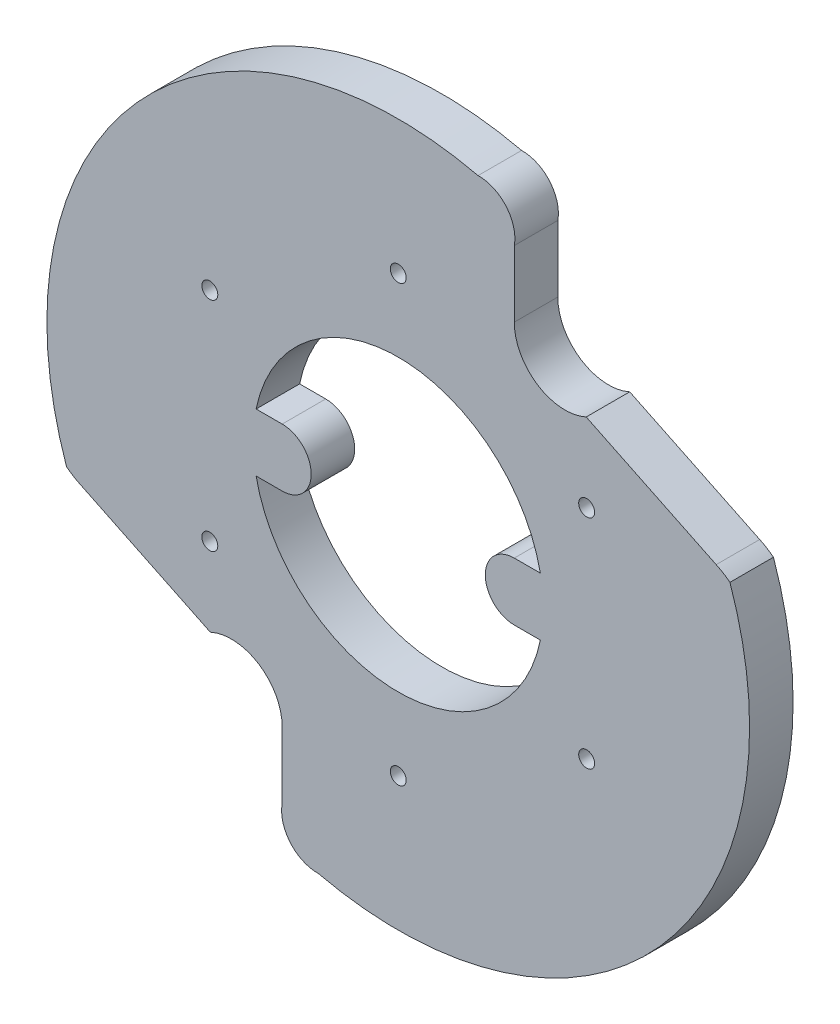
ISO-10303-21;
HEADER;
FILE_DESCRIPTION(('STEP AP214'),'2;1');
FILE_NAME('part.step','',(''),(''),'','','');
FILE_SCHEMA(('AUTOMOTIVE_DESIGN { 1 0 10303 214 1 1 1 1 }'));
ENDSEC;
DATA;
#1=APPLICATION_CONTEXT('core data for automotive mechanical design processes');
#2=APPLICATION_PROTOCOL_DEFINITION('international standard','automotive_design',2000,#1);
#3=PRODUCT_CONTEXT('',#1,'mechanical');
#4=PRODUCT('Part','Part','',(#3));
#5=PRODUCT_RELATED_PRODUCT_CATEGORY('part','',(#4));
#6=PRODUCT_DEFINITION_FORMATION('','',#4);
#7=PRODUCT_DEFINITION_CONTEXT('part definition',#1,'design');
#8=PRODUCT_DEFINITION('design','',#6,#7);
#9=PRODUCT_DEFINITION_SHAPE('','',#8);
#10=(LENGTH_UNIT() NAMED_UNIT(*) SI_UNIT(.MILLI.,.METRE.));
#11=(NAMED_UNIT(*) PLANE_ANGLE_UNIT() SI_UNIT($,.RADIAN.));
#12=(NAMED_UNIT(*) SI_UNIT($,.STERADIAN.) SOLID_ANGLE_UNIT());
#13=UNCERTAINTY_MEASURE_WITH_UNIT(LENGTH_MEASURE(1.E-05),#10,'distance_accuracy_value','');
#14=(GEOMETRIC_REPRESENTATION_CONTEXT(3) GLOBAL_UNCERTAINTY_ASSIGNED_CONTEXT((#13)) GLOBAL_UNIT_ASSIGNED_CONTEXT((#10,
#11,#12)) REPRESENTATION_CONTEXT('',''));
#15=CARTESIAN_POINT('',(0.,0.,0.));
#16=DIRECTION('',(0.,0.,1.));
#17=DIRECTION('',(1.,0.,0.));
#18=AXIS2_PLACEMENT_3D('',#15,#16,#17);
#19=CARTESIAN_POINT('',(0.,-7.77547884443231E-13,6.));
#20=DIRECTION('',(0.,0.,-1.));
#21=DIRECTION('',(-1.,0.,0.));
#22=AXIS2_PLACEMENT_3D('',#19,#20,#21);
#23=PLANE('',#22);
#24=CARTESIAN_POINT('',(-25.9807621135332,-15.0000000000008,6.));
#25=DIRECTION('',(0.,0.,1.));
#26=DIRECTION('',(1.,0.,0.));
#27=AXIS2_PLACEMENT_3D('',#24,#25,#26);
#28=CIRCLE('',#27,1.1);
#29=CARTESIAN_POINT('',(-24.8807621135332,-15.0000000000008,6.));
#30=VERTEX_POINT('',#29);
#31=EDGE_CURVE('E649',#30,#30,#28,.T.);
#32=ORIENTED_EDGE('',*,*,#31,.F.);
#33=EDGE_LOOP('',(#32));
#34=FACE_BOUND('',#33,.T.);
#35=CARTESIAN_POINT('',(25.9807621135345,-15.,6.));
#36=DIRECTION('',(0.,0.,1.));
#37=DIRECTION('',(1.,0.,0.));
#38=AXIS2_PLACEMENT_3D('',#35,#36,#37);
#39=CIRCLE('',#38,1.1);
#40=CARTESIAN_POINT('',(27.0807621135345,-15.,6.));
#41=VERTEX_POINT('',#40);
#42=EDGE_CURVE('E661',#41,#41,#39,.T.);
#43=ORIENTED_EDGE('',*,*,#42,.F.);
#44=EDGE_LOOP('',(#43));
#45=FACE_BOUND('',#44,.T.);
#46=CARTESIAN_POINT('',(0.,30.0000000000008,6.));
#47=DIRECTION('',(0.,0.,1.));
#48=DIRECTION('',(1.,0.,0.));
#49=AXIS2_PLACEMENT_3D('',#46,#47,#48);
#50=CIRCLE('',#49,1.1);
#51=CARTESIAN_POINT('',(1.1,30.0000000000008,6.));
#52=VERTEX_POINT('',#51);
#53=EDGE_CURVE('E212',#52,#52,#50,.T.);
#54=ORIENTED_EDGE('',*,*,#53,.F.);
#55=EDGE_LOOP('',(#54));
#56=FACE_BOUND('',#55,.T.);
#57=CARTESIAN_POINT('',(0.,-7.77547884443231E-13,6.));
#58=DIRECTION('',(0.,0.,1.));
#59=DIRECTION('',(-1.,0.,0.));
#60=AXIS2_PLACEMENT_3D('',#57,#58,#59);
#61=CIRCLE('',#60,48.4425133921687);
#62=CARTESIAN_POINT('',(11.0082214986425,47.1751646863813,6.));
#63=VERTEX_POINT('',#62);
#64=CARTESIAN_POINT('',(-45.734120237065,-15.9708280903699,6.));
#65=VERTEX_POINT('',#64);
#66=EDGE_CURVE('E242',#63,#65,#61,.T.);
#67=ORIENTED_EDGE('',*,*,#66,.T.);
#68=CARTESIAN_POINT('',(-39.5815499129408,-8.08756237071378,6.));
#69=DIRECTION('',(0.,0.,1.));
#70=DIRECTION('',(-1.,0.,0.));
#71=AXIS2_PLACEMENT_3D('',#68,#69,#70);
#72=CIRCLE('',#71,10.);
#73=CARTESIAN_POINT('',(-43.8383260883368,-17.1363112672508,6.));
#74=VERTEX_POINT('',#73);
#75=EDGE_CURVE('E245',#65,#74,#72,.T.);
#76=ORIENTED_EDGE('',*,*,#75,.T.);
#77=DIRECTION('',(0.900284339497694,-0.435302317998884,0.));
#78=VECTOR('',#77,1.);
#79=CARTESIAN_POINT('',(-25.9127678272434,-25.8036141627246,6.));
#80=LINE('',#79,#78);
#81=CARTESIAN_POINT('',(-25.9127678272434,-25.8036141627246,6.));
#82=VERTEX_POINT('',#81);
#83=EDGE_CURVE('E248',#74,#82,#80,.T.);
#84=ORIENTED_EDGE('',*,*,#83,.T.);
#85=CARTESIAN_POINT('',(-23.,-32.1688151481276,6.));
#86=DIRECTION('',(0.,0.,-1.));
#87=DIRECTION('',(-1.,0.,0.));
#88=AXIS2_PLACEMENT_3D('',#85,#86,#87);
#89=CIRCLE('',#88,7.);
#90=CARTESIAN_POINT('',(-16.,-32.1688151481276,6.));
#91=VERTEX_POINT('',#90);
#92=EDGE_CURVE('E250',#82,#91,#89,.T.);
#93=ORIENTED_EDGE('',*,*,#92,.T.);
#94=DIRECTION('',(0.,-1.,0.));
#95=VECTOR('',#94,1.);
#96=CARTESIAN_POINT('',(-16.,-32.1688151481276,6.));
#97=LINE('',#96,#95);
#98=CARTESIAN_POINT('',(-16.,-41.3096230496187,6.));
#99=VERTEX_POINT('',#98);
#100=EDGE_CURVE('E252',#91,#99,#97,.T.);
#101=ORIENTED_EDGE('',*,*,#100,.T.);
#102=CARTESIAN_POINT('',(-11.0938061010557,-42.1911413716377,6.));
#103=DIRECTION('',(0.,0.,1.));
#104=DIRECTION('',(-1.,0.,0.));
#105=AXIS2_PLACEMENT_3D('',#102,#103,#104);
#106=CIRCLE('',#105,4.98475808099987);
#107=CARTESIAN_POINT('',(-11.0082214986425,-47.1751646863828,6.));
#108=VERTEX_POINT('',#107);
#109=EDGE_CURVE('E254',#99,#108,#106,.T.);
#110=ORIENTED_EDGE('',*,*,#109,.T.);
#111=CARTESIAN_POINT('',(0.,-7.77547884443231E-13,6.));
#112=DIRECTION('',(0.,0.,1.));
#113=DIRECTION('',(-1.,0.,0.));
#114=AXIS2_PLACEMENT_3D('',#111,#112,#113);
#115=CIRCLE('',#114,48.4425133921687);
#116=CARTESIAN_POINT('',(45.734120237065,15.9708280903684,6.));
#117=VERTEX_POINT('',#116);
#118=EDGE_CURVE('E256',#108,#117,#115,.T.);
#119=ORIENTED_EDGE('',*,*,#118,.T.);
#120=CARTESIAN_POINT('',(39.5815499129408,8.08756237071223,6.));
#121=DIRECTION('',(0.,0.,1.));
#122=DIRECTION('',(-1.,0.,0.));
#123=AXIS2_PLACEMENT_3D('',#120,#121,#122);
#124=CIRCLE('',#123,10.);
#125=CARTESIAN_POINT('',(43.8383260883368,17.1363112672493,6.));
#126=VERTEX_POINT('',#125);
#127=EDGE_CURVE('E258',#117,#126,#124,.T.);
#128=ORIENTED_EDGE('',*,*,#127,.T.);
#129=DIRECTION('',(-0.900284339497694,0.435302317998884,0.));
#130=VECTOR('',#129,1.);
#131=CARTESIAN_POINT('',(25.9127678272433,25.803614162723,6.));
#132=LINE('',#131,#130);
#133=CARTESIAN_POINT('',(25.9127678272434,25.803614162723,6.));
#134=VERTEX_POINT('',#133);
#135=EDGE_CURVE('E260',#126,#134,#132,.T.);
#136=ORIENTED_EDGE('',*,*,#135,.T.);
#137=CARTESIAN_POINT('',(23.,32.1688151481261,6.));
#138=DIRECTION('',(0.,0.,-1.));
#139=DIRECTION('',(-1.,0.,0.));
#140=AXIS2_PLACEMENT_3D('',#137,#138,#139);
#141=CIRCLE('',#140,7.);
#142=CARTESIAN_POINT('',(16.,32.1688151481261,6.));
#143=VERTEX_POINT('',#142);
#144=EDGE_CURVE('E262',#134,#143,#141,.T.);
#145=ORIENTED_EDGE('',*,*,#144,.T.);
#146=DIRECTION('',(0.,1.,0.));
#147=VECTOR('',#146,1.);
#148=CARTESIAN_POINT('',(16.,32.1688151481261,6.));
#149=LINE('',#148,#147);
#150=CARTESIAN_POINT('',(16.,41.3096230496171,6.));
#151=VERTEX_POINT('',#150);
#152=EDGE_CURVE('E264',#143,#151,#149,.T.);
#153=ORIENTED_EDGE('',*,*,#152,.T.);
#154=CARTESIAN_POINT('',(11.0938061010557,42.1911413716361,6.));
#155=DIRECTION('',(0.,0.,1.));
#156=DIRECTION('',(-1.,0.,0.));
#157=AXIS2_PLACEMENT_3D('',#154,#155,#156);
#158=CIRCLE('',#157,4.98475808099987);
#159=EDGE_CURVE('E266',#151,#63,#158,.T.);
#160=ORIENTED_EDGE('',*,*,#159,.T.);
#161=EDGE_LOOP('',(#67,#76,#84,#93,#101,#110,#119,#128,#136,#145,#153,#160));
#162=FACE_BOUND('',#161,.T.);
#163=CARTESIAN_POINT('',(0.,-7.77547884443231E-13,6.));
#164=DIRECTION('',(0.,0.,1.));
#165=DIRECTION('',(1.,0.,0.));
#166=AXIS2_PLACEMENT_3D('',#163,#164,#165);
#167=CIRCLE('',#166,20.);
#168=CARTESIAN_POINT('',(19.5959179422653,4.,6.));
#169=VERTEX_POINT('',#168);
#170=CARTESIAN_POINT('',(-19.5959179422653,4.,6.));
#171=VERTEX_POINT('',#170);
#172=EDGE_CURVE('E174',#169,#171,#167,.T.);
#173=ORIENTED_EDGE('',*,*,#172,.F.);
#174=DIRECTION('',(1.,0.,0.));
#175=VECTOR('',#174,1.);
#176=CARTESIAN_POINT('',(16.,4.,6.));
#177=LINE('',#176,#175);
#178=CARTESIAN_POINT('',(16.,4.,6.));
#179=VERTEX_POINT('',#178);
#180=EDGE_CURVE('E209',#179,#169,#177,.T.);
#181=ORIENTED_EDGE('',*,*,#180,.F.);
#182=CARTESIAN_POINT('',(16.,0.,6.));
#183=DIRECTION('',(0.,0.,-1.));
#184=DIRECTION('',(-1.,0.,0.));
#185=AXIS2_PLACEMENT_3D('',#182,#183,#184);
#186=CIRCLE('',#185,4.);
#187=CARTESIAN_POINT('',(16.,-4.,6.));
#188=VERTEX_POINT('',#187);
#189=EDGE_CURVE('E207',#188,#179,#186,.T.);
#190=ORIENTED_EDGE('',*,*,#189,.F.);
#191=DIRECTION('',(-1.,0.,0.));
#192=VECTOR('',#191,1.);
#193=CARTESIAN_POINT('',(16.,-4.,6.));
#194=LINE('',#193,#192);
#195=CARTESIAN_POINT('',(19.5959179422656,-4.,6.));
#196=VERTEX_POINT('',#195);
#197=EDGE_CURVE('E205',#196,#188,#194,.T.);
#198=ORIENTED_EDGE('',*,*,#197,.F.);
#199=CARTESIAN_POINT('',(0.,-7.77547884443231E-13,6.));
#200=DIRECTION('',(0.,0.,1.));
#201=DIRECTION('',(1.,0.,0.));
#202=AXIS2_PLACEMENT_3D('',#199,#200,#201);
#203=CIRCLE('',#202,20.);
#204=CARTESIAN_POINT('',(-19.5959179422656,-4.,6.));
#205=VERTEX_POINT('',#204);
#206=EDGE_CURVE('E203',#205,#196,#203,.T.);
#207=ORIENTED_EDGE('',*,*,#206,.F.);
#208=DIRECTION('',(-1.,0.,0.));
#209=VECTOR('',#208,1.);
#210=CARTESIAN_POINT('',(-16.,-4.,6.));
#211=LINE('',#210,#209);
#212=CARTESIAN_POINT('',(-16.,-4.,6.));
#213=VERTEX_POINT('',#212);
#214=EDGE_CURVE('E198',#213,#205,#211,.T.);
#215=ORIENTED_EDGE('',*,*,#214,.F.);
#216=CARTESIAN_POINT('',(-16.,0.,6.));
#217=DIRECTION('',(0.,0.,-1.));
#218=DIRECTION('',(1.,0.,0.));
#219=AXIS2_PLACEMENT_3D('',#216,#217,#218);
#220=CIRCLE('',#219,4.);
#221=CARTESIAN_POINT('',(-16.,4.,6.));
#222=VERTEX_POINT('',#221);
#223=EDGE_CURVE('E196',#222,#213,#220,.T.);
#224=ORIENTED_EDGE('',*,*,#223,.F.);
#225=DIRECTION('',(1.,0.,0.));
#226=VECTOR('',#225,1.);
#227=CARTESIAN_POINT('',(-16.,4.,6.));
#228=LINE('',#227,#226);
#229=EDGE_CURVE('E182',#171,#222,#228,.T.);
#230=ORIENTED_EDGE('',*,*,#229,.F.);
#231=EDGE_LOOP('',(#173,#181,#190,#198,#207,#215,#224,#230));
#232=FACE_BOUND('',#231,.T.);
#233=CARTESIAN_POINT('',(25.9807621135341,15.0000000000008,6.));
#234=DIRECTION('',(0.,0.,1.));
#235=DIRECTION('',(1.,0.,0.));
#236=AXIS2_PLACEMENT_3D('',#233,#234,#235);
#237=CIRCLE('',#236,1.1);
#238=CARTESIAN_POINT('',(27.0807621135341,15.0000000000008,6.));
#239=VERTEX_POINT('',#238);
#240=EDGE_CURVE('E667',#239,#239,#237,.T.);
#241=ORIENTED_EDGE('',*,*,#240,.F.);
#242=EDGE_LOOP('',(#241));
#243=FACE_BOUND('',#242,.T.);
#244=CARTESIAN_POINT('',(8.31799906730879E-13,-30.0000000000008,6.));
#245=DIRECTION('',(0.,0.,1.));
#246=DIRECTION('',(1.,0.,0.));
#247=AXIS2_PLACEMENT_3D('',#244,#245,#246);
#248=CIRCLE('',#247,1.1);
#249=CARTESIAN_POINT('',(1.10000000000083,-30.0000000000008,6.));
#250=VERTEX_POINT('',#249);
#251=EDGE_CURVE('E655',#250,#250,#248,.T.);
#252=ORIENTED_EDGE('',*,*,#251,.F.);
#253=EDGE_LOOP('',(#252));
#254=FACE_BOUND('',#253,.T.);
#255=CARTESIAN_POINT('',(-25.9807621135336,15.,6.));
#256=DIRECTION('',(0.,0.,1.));
#257=DIRECTION('',(1.,0.,0.));
#258=AXIS2_PLACEMENT_3D('',#255,#256,#257);
#259=CIRCLE('',#258,1.1);
#260=CARTESIAN_POINT('',(-24.8807621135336,15.,6.));
#261=VERTEX_POINT('',#260);
#262=EDGE_CURVE('E640',#261,#261,#259,.T.);
#263=ORIENTED_EDGE('',*,*,#262,.F.);
#264=EDGE_LOOP('',(#263));
#265=FACE_BOUND('',#264,.T.);
#266=ADVANCED_FACE('F37',(#34,#45,#56,#162,#232,#243,#254,#265),#23,.F.);
#267=CARTESIAN_POINT('',(0.,-7.77547884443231E-13,0.));
#268=DIRECTION('',(0.,0.,-1.));
#269=DIRECTION('',(-1.,0.,0.));
#270=AXIS2_PLACEMENT_3D('',#267,#268,#269);
#271=PLANE('',#270);
#272=CARTESIAN_POINT('',(-25.9807621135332,-15.0000000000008,0.));
#273=DIRECTION('',(0.,0.,1.));
#274=DIRECTION('',(1.,0.,0.));
#275=AXIS2_PLACEMENT_3D('',#272,#273,#274);
#276=CIRCLE('',#275,1.1);
#277=CARTESIAN_POINT('',(-24.8807621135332,-15.0000000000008,0.));
#278=VERTEX_POINT('',#277);
#279=EDGE_CURVE('E646',#278,#278,#276,.T.);
#280=ORIENTED_EDGE('',*,*,#279,.T.);
#281=EDGE_LOOP('',(#280));
#282=FACE_BOUND('',#281,.T.);
#283=CARTESIAN_POINT('',(25.9807621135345,-15.,0.));
#284=DIRECTION('',(0.,0.,1.));
#285=DIRECTION('',(1.,0.,0.));
#286=AXIS2_PLACEMENT_3D('',#283,#284,#285);
#287=CIRCLE('',#286,1.1);
#288=CARTESIAN_POINT('',(27.0807621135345,-15.,0.));
#289=VERTEX_POINT('',#288);
#290=EDGE_CURVE('E658',#289,#289,#287,.T.);
#291=ORIENTED_EDGE('',*,*,#290,.T.);
#292=EDGE_LOOP('',(#291));
#293=FACE_BOUND('',#292,.T.);
#294=CARTESIAN_POINT('',(0.,30.0000000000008,0.));
#295=DIRECTION('',(0.,0.,1.));
#296=DIRECTION('',(1.,0.,0.));
#297=AXIS2_PLACEMENT_3D('',#294,#295,#296);
#298=CIRCLE('',#297,1.1);
#299=CARTESIAN_POINT('',(1.1,30.0000000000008,0.));
#300=VERTEX_POINT('',#299);
#301=EDGE_CURVE('E670',#300,#300,#298,.T.);
#302=ORIENTED_EDGE('',*,*,#301,.T.);
#303=EDGE_LOOP('',(#302));
#304=FACE_BOUND('',#303,.T.);
#305=CARTESIAN_POINT('',(-39.5815499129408,-8.08756237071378,0.));
#306=DIRECTION('',(0.,0.,1.));
#307=DIRECTION('',(-1.,0.,0.));
#308=AXIS2_PLACEMENT_3D('',#305,#306,#307);
#309=CIRCLE('',#308,10.);
#310=CARTESIAN_POINT('',(-45.734120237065,-15.9708280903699,0.));
#311=VERTEX_POINT('',#310);
#312=CARTESIAN_POINT('',(-43.8383260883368,-17.1363112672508,0.));
#313=VERTEX_POINT('',#312);
#314=EDGE_CURVE('E190',#311,#313,#309,.T.);
#315=ORIENTED_EDGE('',*,*,#314,.F.);
#316=CARTESIAN_POINT('',(0.,-7.77547884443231E-13,0.));
#317=DIRECTION('',(0.,0.,1.));
#318=DIRECTION('',(-1.,0.,0.));
#319=AXIS2_PLACEMENT_3D('',#316,#317,#318);
#320=CIRCLE('',#319,48.4425133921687);
#321=CARTESIAN_POINT('',(11.0082214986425,47.1751646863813,0.));
#322=VERTEX_POINT('',#321);
#323=EDGE_CURVE('E246',#322,#311,#320,.T.);
#324=ORIENTED_EDGE('',*,*,#323,.F.);
#325=CARTESIAN_POINT('',(11.0938061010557,42.1911413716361,0.));
#326=DIRECTION('',(0.,0.,1.));
#327=DIRECTION('',(-1.,0.,0.));
#328=AXIS2_PLACEMENT_3D('',#325,#326,#327);
#329=CIRCLE('',#328,4.98475808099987);
#330=CARTESIAN_POINT('',(16.,41.3096230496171,0.));
#331=VERTEX_POINT('',#330);
#332=EDGE_CURVE('E290',#331,#322,#329,.T.);
#333=ORIENTED_EDGE('',*,*,#332,.F.);
#334=DIRECTION('',(0.,1.,0.));
#335=VECTOR('',#334,1.);
#336=CARTESIAN_POINT('',(16.,32.1688151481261,0.));
#337=LINE('',#336,#335);
#338=CARTESIAN_POINT('',(16.,32.1688151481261,0.));
#339=VERTEX_POINT('',#338);
#340=EDGE_CURVE('E288',#339,#331,#337,.T.);
#341=ORIENTED_EDGE('',*,*,#340,.F.);
#342=CARTESIAN_POINT('',(23.,32.1688151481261,0.));
#343=DIRECTION('',(0.,0.,-1.));
#344=DIRECTION('',(-1.,0.,0.));
#345=AXIS2_PLACEMENT_3D('',#342,#343,#344);
#346=CIRCLE('',#345,7.);
#347=CARTESIAN_POINT('',(25.9127678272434,25.803614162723,0.));
#348=VERTEX_POINT('',#347);
#349=EDGE_CURVE('E286',#348,#339,#346,.T.);
#350=ORIENTED_EDGE('',*,*,#349,.F.);
#351=DIRECTION('',(-0.900284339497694,0.435302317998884,0.));
#352=VECTOR('',#351,1.);
#353=CARTESIAN_POINT('',(25.9127678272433,25.803614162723,0.));
#354=LINE('',#353,#352);
#355=CARTESIAN_POINT('',(43.8383260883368,17.1363112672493,0.));
#356=VERTEX_POINT('',#355);
#357=EDGE_CURVE('E284',#356,#348,#354,.T.);
#358=ORIENTED_EDGE('',*,*,#357,.F.);
#359=CARTESIAN_POINT('',(39.5815499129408,8.08756237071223,0.));
#360=DIRECTION('',(0.,0.,1.));
#361=DIRECTION('',(-1.,0.,0.));
#362=AXIS2_PLACEMENT_3D('',#359,#360,#361);
#363=CIRCLE('',#362,10.);
#364=CARTESIAN_POINT('',(45.734120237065,15.9708280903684,0.));
#365=VERTEX_POINT('',#364);
#366=EDGE_CURVE('E282',#365,#356,#363,.T.);
#367=ORIENTED_EDGE('',*,*,#366,.F.);
#368=CARTESIAN_POINT('',(0.,-7.77547884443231E-13,0.));
#369=DIRECTION('',(0.,0.,1.));
#370=DIRECTION('',(-1.,0.,0.));
#371=AXIS2_PLACEMENT_3D('',#368,#369,#370);
#372=CIRCLE('',#371,48.4425133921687);
#373=CARTESIAN_POINT('',(-11.0082214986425,-47.1751646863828,0.));
#374=VERTEX_POINT('',#373);
#375=EDGE_CURVE('E280',#374,#365,#372,.T.);
#376=ORIENTED_EDGE('',*,*,#375,.F.);
#377=CARTESIAN_POINT('',(-11.0938061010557,-42.1911413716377,0.));
#378=DIRECTION('',(0.,0.,1.));
#379=DIRECTION('',(-1.,0.,0.));
#380=AXIS2_PLACEMENT_3D('',#377,#378,#379);
#381=CIRCLE('',#380,4.98475808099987);
#382=CARTESIAN_POINT('',(-16.,-41.3096230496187,0.));
#383=VERTEX_POINT('',#382);
#384=EDGE_CURVE('E277',#383,#374,#381,.T.);
#385=ORIENTED_EDGE('',*,*,#384,.F.);
#386=DIRECTION('',(0.,-1.,0.));
#387=VECTOR('',#386,1.);
#388=CARTESIAN_POINT('',(-16.,-32.1688151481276,0.));
#389=LINE('',#388,#387);
#390=CARTESIAN_POINT('',(-16.,-32.1688151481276,0.));
#391=VERTEX_POINT('',#390);
#392=EDGE_CURVE('E275',#391,#383,#389,.T.);
#393=ORIENTED_EDGE('',*,*,#392,.F.);
#394=CARTESIAN_POINT('',(-23.,-32.1688151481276,0.));
#395=DIRECTION('',(0.,0.,-1.));
#396=DIRECTION('',(-1.,0.,0.));
#397=AXIS2_PLACEMENT_3D('',#394,#395,#396);
#398=CIRCLE('',#397,7.);
#399=CARTESIAN_POINT('',(-25.9127678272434,-25.8036141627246,0.));
#400=VERTEX_POINT('',#399);
#401=EDGE_CURVE('E273',#400,#391,#398,.T.);
#402=ORIENTED_EDGE('',*,*,#401,.F.);
#403=DIRECTION('',(0.900284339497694,-0.435302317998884,0.));
#404=VECTOR('',#403,1.);
#405=CARTESIAN_POINT('',(-25.9127678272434,-25.8036141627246,0.));
#406=LINE('',#405,#404);
#407=EDGE_CURVE('E271',#313,#400,#406,.T.);
#408=ORIENTED_EDGE('',*,*,#407,.F.);
#409=EDGE_LOOP('',(#315,#324,#333,#341,#350,#358,#367,#376,#385,#393,#402,#408));
#410=FACE_BOUND('',#409,.T.);
#411=DIRECTION('',(1.,0.,0.));
#412=VECTOR('',#411,1.);
#413=CARTESIAN_POINT('',(16.,4.,0.));
#414=LINE('',#413,#412);
#415=CARTESIAN_POINT('',(16.,4.,0.));
#416=VERTEX_POINT('',#415);
#417=CARTESIAN_POINT('',(19.5959179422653,4.,0.));
#418=VERTEX_POINT('',#417);
#419=EDGE_CURVE('E183',#416,#418,#414,.T.);
#420=ORIENTED_EDGE('',*,*,#419,.T.);
#421=CARTESIAN_POINT('',(0.,-7.77547884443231E-13,0.));
#422=DIRECTION('',(0.,0.,1.));
#423=DIRECTION('',(1.,0.,0.));
#424=AXIS2_PLACEMENT_3D('',#421,#422,#423);
#425=CIRCLE('',#424,20.);
#426=CARTESIAN_POINT('',(-19.5959179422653,4.,0.));
#427=VERTEX_POINT('',#426);
#428=EDGE_CURVE('E60',#418,#427,#425,.T.);
#429=ORIENTED_EDGE('',*,*,#428,.T.);
#430=DIRECTION('',(1.,0.,0.));
#431=VECTOR('',#430,1.);
#432=CARTESIAN_POINT('',(-16.,4.,0.));
#433=LINE('',#432,#431);
#434=CARTESIAN_POINT('',(-16.,4.,0.));
#435=VERTEX_POINT('',#434);
#436=EDGE_CURVE('E189',#427,#435,#433,.T.);
#437=ORIENTED_EDGE('',*,*,#436,.T.);
#438=CARTESIAN_POINT('',(-16.,0.,0.));
#439=DIRECTION('',(0.,0.,-1.));
#440=DIRECTION('',(1.,0.,0.));
#441=AXIS2_PLACEMENT_3D('',#438,#439,#440);
#442=CIRCLE('',#441,4.);
#443=CARTESIAN_POINT('',(-16.,-4.,0.));
#444=VERTEX_POINT('',#443);
#445=EDGE_CURVE('E214',#435,#444,#442,.T.);
#446=ORIENTED_EDGE('',*,*,#445,.T.);
#447=DIRECTION('',(-1.,0.,0.));
#448=VECTOR('',#447,1.);
#449=CARTESIAN_POINT('',(-16.,-4.,0.));
#450=LINE('',#449,#448);
#451=CARTESIAN_POINT('',(-19.5959179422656,-4.,0.));
#452=VERTEX_POINT('',#451);
#453=EDGE_CURVE('E217',#444,#452,#450,.T.);
#454=ORIENTED_EDGE('',*,*,#453,.T.);
#455=CARTESIAN_POINT('',(0.,-7.77547884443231E-13,0.));
#456=DIRECTION('',(0.,0.,1.));
#457=DIRECTION('',(1.,0.,0.));
#458=AXIS2_PLACEMENT_3D('',#455,#456,#457);
#459=CIRCLE('',#458,20.);
#460=CARTESIAN_POINT('',(19.5959179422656,-4.,0.));
#461=VERTEX_POINT('',#460);
#462=EDGE_CURVE('E220',#452,#461,#459,.T.);
#463=ORIENTED_EDGE('',*,*,#462,.T.);
#464=DIRECTION('',(-1.,0.,0.));
#465=VECTOR('',#464,1.);
#466=CARTESIAN_POINT('',(16.,-4.,0.));
#467=LINE('',#466,#465);
#468=CARTESIAN_POINT('',(16.,-4.,0.));
#469=VERTEX_POINT('',#468);
#470=EDGE_CURVE('E223',#461,#469,#467,.T.);
#471=ORIENTED_EDGE('',*,*,#470,.T.);
#472=CARTESIAN_POINT('',(16.,0.,0.));
#473=DIRECTION('',(0.,0.,-1.));
#474=DIRECTION('',(-1.,0.,0.));
#475=AXIS2_PLACEMENT_3D('',#472,#473,#474);
#476=CIRCLE('',#475,4.);
#477=EDGE_CURVE('E226',#469,#416,#476,.T.);
#478=ORIENTED_EDGE('',*,*,#477,.T.);
#479=EDGE_LOOP('',(#420,#429,#437,#446,#454,#463,#471,#478));
#480=FACE_BOUND('',#479,.T.);
#481=CARTESIAN_POINT('',(25.9807621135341,15.0000000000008,0.));
#482=DIRECTION('',(0.,0.,1.));
#483=DIRECTION('',(1.,0.,0.));
#484=AXIS2_PLACEMENT_3D('',#481,#482,#483);
#485=CIRCLE('',#484,1.1);
#486=CARTESIAN_POINT('',(27.0807621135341,15.0000000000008,0.));
#487=VERTEX_POINT('',#486);
#488=EDGE_CURVE('E664',#487,#487,#485,.T.);
#489=ORIENTED_EDGE('',*,*,#488,.T.);
#490=EDGE_LOOP('',(#489));
#491=FACE_BOUND('',#490,.T.);
#492=CARTESIAN_POINT('',(8.31799906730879E-13,-30.0000000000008,0.));
#493=DIRECTION('',(0.,0.,1.));
#494=DIRECTION('',(1.,0.,0.));
#495=AXIS2_PLACEMENT_3D('',#492,#493,#494);
#496=CIRCLE('',#495,1.1);
#497=CARTESIAN_POINT('',(1.10000000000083,-30.0000000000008,0.));
#498=VERTEX_POINT('',#497);
#499=EDGE_CURVE('E652',#498,#498,#496,.T.);
#500=ORIENTED_EDGE('',*,*,#499,.T.);
#501=EDGE_LOOP('',(#500));
#502=FACE_BOUND('',#501,.T.);
#503=CARTESIAN_POINT('',(-25.9807621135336,15.,0.));
#504=DIRECTION('',(0.,0.,1.));
#505=DIRECTION('',(1.,0.,0.));
#506=AXIS2_PLACEMENT_3D('',#503,#504,#505);
#507=CIRCLE('',#506,1.1);
#508=CARTESIAN_POINT('',(-24.8807621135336,15.,0.));
#509=VERTEX_POINT('',#508);
#510=EDGE_CURVE('E643',#509,#509,#507,.T.);
#511=ORIENTED_EDGE('',*,*,#510,.T.);
#512=EDGE_LOOP('',(#511));
#513=FACE_BOUND('',#512,.T.);
#514=ADVANCED_FACE('F332',(#282,#293,#304,#410,#480,#491,#502,#513),#271,.T.);
#515=CARTESIAN_POINT('',(-39.5815499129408,-8.08756237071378,6.));
#516=DIRECTION('',(0.,0.,-1.));
#517=DIRECTION('',(-1.,0.,0.));
#518=AXIS2_PLACEMENT_3D('',#515,#516,#517);
#519=CYLINDRICAL_SURFACE('',#518,10.);
#520=ORIENTED_EDGE('',*,*,#314,.T.);
#521=DIRECTION('',(0.,0.,-1.));
#522=VECTOR('',#521,1.);
#523=CARTESIAN_POINT('',(-43.8383260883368,-17.1363112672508,6.));
#524=LINE('',#523,#522);
#525=EDGE_CURVE('E45',#74,#313,#524,.T.);
#526=ORIENTED_EDGE('',*,*,#525,.F.);
#527=ORIENTED_EDGE('',*,*,#75,.F.);
#528=DIRECTION('',(0.,0.,-1.));
#529=VECTOR('',#528,1.);
#530=CARTESIAN_POINT('',(-45.734120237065,-15.9708280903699,6.));
#531=LINE('',#530,#529);
#532=EDGE_CURVE('E11',#65,#311,#531,.T.);
#533=ORIENTED_EDGE('',*,*,#532,.T.);
#534=EDGE_LOOP('',(#520,#526,#527,#533));
#535=FACE_BOUND('',#534,.T.);
#536=ADVANCED_FACE('F39',(#535),#519,.T.);
#537=CARTESIAN_POINT('',(-25.9127678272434,-25.8036141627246,6.));
#538=DIRECTION('',(0.435302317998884,0.900284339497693,0.));
#539=DIRECTION('',(-0.900284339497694,0.435302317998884,0.));
#540=AXIS2_PLACEMENT_3D('',#537,#538,#539);
#541=PLANE('',#540);
#542=ORIENTED_EDGE('',*,*,#407,.T.);
#543=DIRECTION('',(0.,0.,-1.));
#544=VECTOR('',#543,1.);
#545=CARTESIAN_POINT('',(-25.9127678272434,-25.8036141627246,6.));
#546=LINE('',#545,#544);
#547=EDGE_CURVE('E319',#82,#400,#546,.T.);
#548=ORIENTED_EDGE('',*,*,#547,.F.);
#549=ORIENTED_EDGE('',*,*,#83,.F.);
#550=ORIENTED_EDGE('',*,*,#525,.T.);
#551=EDGE_LOOP('',(#542,#548,#549,#550));
#552=FACE_BOUND('',#551,.T.);
#553=ADVANCED_FACE('F326',(#552),#541,.F.);
#554=CARTESIAN_POINT('',(-23.,-32.1688151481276,6.));
#555=DIRECTION('',(0.,0.,-1.));
#556=DIRECTION('',(-1.,0.,0.));
#557=AXIS2_PLACEMENT_3D('',#554,#555,#556);
#558=CYLINDRICAL_SURFACE('',#557,7.);
#559=ORIENTED_EDGE('',*,*,#401,.T.);
#560=DIRECTION('',(0.,0.,-1.));
#561=VECTOR('',#560,1.);
#562=CARTESIAN_POINT('',(-16.,-32.1688151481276,6.));
#563=LINE('',#562,#561);
#564=EDGE_CURVE('E316',#91,#391,#563,.T.);
#565=ORIENTED_EDGE('',*,*,#564,.F.);
#566=ORIENTED_EDGE('',*,*,#92,.F.);
#567=ORIENTED_EDGE('',*,*,#547,.T.);
#568=EDGE_LOOP('',(#559,#565,#566,#567));
#569=FACE_BOUND('',#568,.T.);
#570=ADVANCED_FACE('F339',(#569),#558,.F.);
#571=CARTESIAN_POINT('',(-16.,-32.1688151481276,6.));
#572=DIRECTION('',(1.,0.,0.));
#573=DIRECTION('',(0.,1.,0.));
#574=AXIS2_PLACEMENT_3D('',#571,#572,#573);
#575=PLANE('',#574);
#576=ORIENTED_EDGE('',*,*,#392,.T.);
#577=DIRECTION('',(0.,0.,-1.));
#578=VECTOR('',#577,1.);
#579=CARTESIAN_POINT('',(-16.,-41.3096230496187,6.));
#580=LINE('',#579,#578);
#581=EDGE_CURVE('E313',#99,#383,#580,.T.);
#582=ORIENTED_EDGE('',*,*,#581,.F.);
#583=ORIENTED_EDGE('',*,*,#100,.F.);
#584=ORIENTED_EDGE('',*,*,#564,.T.);
#585=EDGE_LOOP('',(#576,#582,#583,#584));
#586=FACE_BOUND('',#585,.T.);
#587=ADVANCED_FACE('F343',(#586),#575,.F.);
#588=CARTESIAN_POINT('',(-11.0938061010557,-42.1911413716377,6.));
#589=DIRECTION('',(0.,0.,-1.));
#590=DIRECTION('',(-1.,0.,0.));
#591=AXIS2_PLACEMENT_3D('',#588,#589,#590);
#592=CYLINDRICAL_SURFACE('',#591,4.98475808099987);
#593=ORIENTED_EDGE('',*,*,#384,.T.);
#594=DIRECTION('',(0.,0.,-1.));
#595=VECTOR('',#594,1.);
#596=CARTESIAN_POINT('',(-11.0082214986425,-47.1751646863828,6.));
#597=LINE('',#596,#595);
#598=EDGE_CURVE('E310',#108,#374,#597,.T.);
#599=ORIENTED_EDGE('',*,*,#598,.F.);
#600=ORIENTED_EDGE('',*,*,#109,.F.);
#601=ORIENTED_EDGE('',*,*,#581,.T.);
#602=EDGE_LOOP('',(#593,#599,#600,#601));
#603=FACE_BOUND('',#602,.T.);
#604=ADVANCED_FACE('F381',(#603),#592,.T.);
#605=CARTESIAN_POINT('',(0.,-7.77547884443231E-13,6.));
#606=DIRECTION('',(0.,0.,-1.));
#607=DIRECTION('',(-1.,0.,0.));
#608=AXIS2_PLACEMENT_3D('',#605,#606,#607);
#609=CYLINDRICAL_SURFACE('',#608,48.4425133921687);
#610=ORIENTED_EDGE('',*,*,#375,.T.);
#611=DIRECTION('',(0.,0.,-1.));
#612=VECTOR('',#611,1.);
#613=CARTESIAN_POINT('',(45.734120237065,15.9708280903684,6.));
#614=LINE('',#613,#612);
#615=EDGE_CURVE('E307',#117,#365,#614,.T.);
#616=ORIENTED_EDGE('',*,*,#615,.F.);
#617=ORIENTED_EDGE('',*,*,#118,.F.);
#618=ORIENTED_EDGE('',*,*,#598,.T.);
#619=EDGE_LOOP('',(#610,#616,#617,#618));
#620=FACE_BOUND('',#619,.T.);
#621=ADVANCED_FACE('F379',(#620),#609,.T.);
#622=CARTESIAN_POINT('',(39.5815499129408,8.08756237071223,6.));
#623=DIRECTION('',(0.,0.,-1.));
#624=DIRECTION('',(-1.,0.,0.));
#625=AXIS2_PLACEMENT_3D('',#622,#623,#624);
#626=CYLINDRICAL_SURFACE('',#625,10.);
#627=ORIENTED_EDGE('',*,*,#366,.T.);
#628=DIRECTION('',(0.,0.,-1.));
#629=VECTOR('',#628,1.);
#630=CARTESIAN_POINT('',(43.8383260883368,17.1363112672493,6.));
#631=LINE('',#630,#629);
#632=EDGE_CURVE('E304',#126,#356,#631,.T.);
#633=ORIENTED_EDGE('',*,*,#632,.F.);
#634=ORIENTED_EDGE('',*,*,#127,.F.);
#635=ORIENTED_EDGE('',*,*,#615,.T.);
#636=EDGE_LOOP('',(#627,#633,#634,#635));
#637=FACE_BOUND('',#636,.T.);
#638=ADVANCED_FACE('F375',(#637),#626,.T.);
#639=CARTESIAN_POINT('',(25.9127678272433,25.803614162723,6.));
#640=DIRECTION('',(-0.435302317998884,-0.900284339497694,0.));
#641=DIRECTION('',(0.900284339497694,-0.435302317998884,0.));
#642=AXIS2_PLACEMENT_3D('',#639,#640,#641);
#643=PLANE('',#642);
#644=ORIENTED_EDGE('',*,*,#357,.T.);
#645=DIRECTION('',(0.,0.,-1.));
#646=VECTOR('',#645,1.);
#647=CARTESIAN_POINT('',(25.9127678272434,25.803614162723,6.));
#648=LINE('',#647,#646);
#649=EDGE_CURVE('E301',#134,#348,#648,.T.);
#650=ORIENTED_EDGE('',*,*,#649,.F.);
#651=ORIENTED_EDGE('',*,*,#135,.F.);
#652=ORIENTED_EDGE('',*,*,#632,.T.);
#653=EDGE_LOOP('',(#644,#650,#651,#652));
#654=FACE_BOUND('',#653,.T.);
#655=ADVANCED_FACE('F370',(#654),#643,.F.);
#656=CARTESIAN_POINT('',(23.,32.1688151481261,6.));
#657=DIRECTION('',(0.,0.,-1.));
#658=DIRECTION('',(-1.,0.,0.));
#659=AXIS2_PLACEMENT_3D('',#656,#657,#658);
#660=CYLINDRICAL_SURFACE('',#659,7.);
#661=ORIENTED_EDGE('',*,*,#349,.T.);
#662=DIRECTION('',(0.,0.,-1.));
#663=VECTOR('',#662,1.);
#664=CARTESIAN_POINT('',(16.,32.1688151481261,6.));
#665=LINE('',#664,#663);
#666=EDGE_CURVE('E298',#143,#339,#665,.T.);
#667=ORIENTED_EDGE('',*,*,#666,.F.);
#668=ORIENTED_EDGE('',*,*,#144,.F.);
#669=ORIENTED_EDGE('',*,*,#649,.T.);
#670=EDGE_LOOP('',(#661,#667,#668,#669));
#671=FACE_BOUND('',#670,.T.);
#672=ADVANCED_FACE('F365',(#671),#660,.F.);
#673=CARTESIAN_POINT('',(16.,32.1688151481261,6.));
#674=DIRECTION('',(-1.,0.,0.));
#675=DIRECTION('',(0.,-1.,0.));
#676=AXIS2_PLACEMENT_3D('',#673,#674,#675);
#677=PLANE('',#676);
#678=ORIENTED_EDGE('',*,*,#340,.T.);
#679=DIRECTION('',(0.,0.,-1.));
#680=VECTOR('',#679,1.);
#681=CARTESIAN_POINT('',(16.,41.3096230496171,6.));
#682=LINE('',#681,#680);
#683=EDGE_CURVE('E295',#151,#331,#682,.T.);
#684=ORIENTED_EDGE('',*,*,#683,.F.);
#685=ORIENTED_EDGE('',*,*,#152,.F.);
#686=ORIENTED_EDGE('',*,*,#666,.T.);
#687=EDGE_LOOP('',(#678,#684,#685,#686));
#688=FACE_BOUND('',#687,.T.);
#689=ADVANCED_FACE('F361',(#688),#677,.F.);
#690=CARTESIAN_POINT('',(11.0938061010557,42.1911413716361,6.));
#691=DIRECTION('',(0.,0.,-1.));
#692=DIRECTION('',(-1.,0.,0.));
#693=AXIS2_PLACEMENT_3D('',#690,#691,#692);
#694=CYLINDRICAL_SURFACE('',#693,4.98475808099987);
#695=ORIENTED_EDGE('',*,*,#332,.T.);
#696=DIRECTION('',(0.,0.,-1.));
#697=VECTOR('',#696,1.);
#698=CARTESIAN_POINT('',(11.0082214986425,47.1751646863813,6.));
#699=LINE('',#698,#697);
#700=EDGE_CURVE('E269',#63,#322,#699,.T.);
#701=ORIENTED_EDGE('',*,*,#700,.F.);
#702=ORIENTED_EDGE('',*,*,#159,.F.);
#703=ORIENTED_EDGE('',*,*,#683,.T.);
#704=EDGE_LOOP('',(#695,#701,#702,#703));
#705=FACE_BOUND('',#704,.T.);
#706=ADVANCED_FACE('F356',(#705),#694,.T.);
#707=CARTESIAN_POINT('',(0.,-7.77547884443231E-13,6.));
#708=DIRECTION('',(0.,0.,-1.));
#709=DIRECTION('',(-1.,0.,0.));
#710=AXIS2_PLACEMENT_3D('',#707,#708,#709);
#711=CYLINDRICAL_SURFACE('',#710,48.4425133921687);
#712=ORIENTED_EDGE('',*,*,#323,.T.);
#713=ORIENTED_EDGE('',*,*,#532,.F.);
#714=ORIENTED_EDGE('',*,*,#66,.F.);
#715=ORIENTED_EDGE('',*,*,#700,.T.);
#716=EDGE_LOOP('',(#712,#713,#714,#715));
#717=FACE_BOUND('',#716,.T.);
#718=ADVANCED_FACE('F350',(#717),#711,.T.);
#719=CARTESIAN_POINT('',(0.,-7.77547884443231E-13,6.));
#720=DIRECTION('',(0.,0.,-1.));
#721=DIRECTION('',(-1.,0.,0.));
#722=AXIS2_PLACEMENT_3D('',#719,#720,#721);
#723=CYLINDRICAL_SURFACE('',#722,20.);
#724=ORIENTED_EDGE('',*,*,#428,.F.);
#725=DIRECTION('',(0.,0.,-1.));
#726=VECTOR('',#725,1.);
#727=CARTESIAN_POINT('',(19.5959179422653,4.,6.));
#728=LINE('',#727,#726);
#729=EDGE_CURVE('E178',#169,#418,#728,.T.);
#730=ORIENTED_EDGE('',*,*,#729,.F.);
#731=ORIENTED_EDGE('',*,*,#172,.T.);
#732=DIRECTION('',(0.,0.,-1.));
#733=VECTOR('',#732,1.);
#734=CARTESIAN_POINT('',(-19.5959179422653,4.,6.));
#735=LINE('',#734,#733);
#736=EDGE_CURVE('E177',#171,#427,#735,.T.);
#737=ORIENTED_EDGE('',*,*,#736,.T.);
#738=EDGE_LOOP('',(#724,#730,#731,#737));
#739=FACE_BOUND('',#738,.T.);
#740=ADVANCED_FACE('F176',(#739),#723,.F.);
#741=CARTESIAN_POINT('',(-16.,4.,6.));
#742=DIRECTION('',(0.,1.,0.));
#743=DIRECTION('',(-1.,0.,0.));
#744=AXIS2_PLACEMENT_3D('',#741,#742,#743);
#745=PLANE('',#744);
#746=ORIENTED_EDGE('',*,*,#436,.F.);
#747=ORIENTED_EDGE('',*,*,#736,.F.);
#748=ORIENTED_EDGE('',*,*,#229,.T.);
#749=DIRECTION('',(0.,0.,-1.));
#750=VECTOR('',#749,1.);
#751=CARTESIAN_POINT('',(-16.,4.,6.));
#752=LINE('',#751,#750);
#753=EDGE_CURVE('E191',#222,#435,#752,.T.);
#754=ORIENTED_EDGE('',*,*,#753,.T.);
#755=EDGE_LOOP('',(#746,#747,#748,#754));
#756=FACE_BOUND('',#755,.T.);
#757=ADVANCED_FACE('F186',(#756),#745,.T.);
#758=CARTESIAN_POINT('',(-16.,0.,6.));
#759=DIRECTION('',(0.,0.,-1.));
#760=DIRECTION('',(-1.,0.,0.));
#761=AXIS2_PLACEMENT_3D('',#758,#759,#760);
#762=CYLINDRICAL_SURFACE('',#761,4.);
#763=ORIENTED_EDGE('',*,*,#445,.F.);
#764=ORIENTED_EDGE('',*,*,#753,.F.);
#765=ORIENTED_EDGE('',*,*,#223,.T.);
#766=DIRECTION('',(0.,0.,-1.));
#767=VECTOR('',#766,1.);
#768=CARTESIAN_POINT('',(-16.,-4.,6.));
#769=LINE('',#768,#767);
#770=EDGE_CURVE('E239',#213,#444,#769,.T.);
#771=ORIENTED_EDGE('',*,*,#770,.T.);
#772=EDGE_LOOP('',(#763,#764,#765,#771));
#773=FACE_BOUND('',#772,.T.);
#774=ADVANCED_FACE('F449',(#773),#762,.T.);
#775=CARTESIAN_POINT('',(-16.,-4.,6.));
#776=DIRECTION('',(0.,-1.,0.));
#777=DIRECTION('',(0.,0.,-1.));
#778=AXIS2_PLACEMENT_3D('',#775,#776,#777);
#779=PLANE('',#778);
#780=ORIENTED_EDGE('',*,*,#453,.F.);
#781=ORIENTED_EDGE('',*,*,#770,.F.);
#782=ORIENTED_EDGE('',*,*,#214,.T.);
#783=DIRECTION('',(0.,0.,-1.));
#784=VECTOR('',#783,1.);
#785=CARTESIAN_POINT('',(-19.5959179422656,-4.,6.));
#786=LINE('',#785,#784);
#787=EDGE_CURVE('E237',#205,#452,#786,.T.);
#788=ORIENTED_EDGE('',*,*,#787,.T.);
#789=EDGE_LOOP('',(#780,#781,#782,#788));
#790=FACE_BOUND('',#789,.T.);
#791=ADVANCED_FACE('F455',(#790),#779,.T.);
#792=CARTESIAN_POINT('',(0.,-7.77547884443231E-13,6.));
#793=DIRECTION('',(0.,0.,-1.));
#794=DIRECTION('',(-1.,0.,0.));
#795=AXIS2_PLACEMENT_3D('',#792,#793,#794);
#796=CYLINDRICAL_SURFACE('',#795,20.);
#797=ORIENTED_EDGE('',*,*,#462,.F.);
#798=ORIENTED_EDGE('',*,*,#787,.F.);
#799=ORIENTED_EDGE('',*,*,#206,.T.);
#800=DIRECTION('',(0.,0.,-1.));
#801=VECTOR('',#800,1.);
#802=CARTESIAN_POINT('',(19.5959179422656,-4.,6.));
#803=LINE('',#802,#801);
#804=EDGE_CURVE('E235',#196,#461,#803,.T.);
#805=ORIENTED_EDGE('',*,*,#804,.T.);
#806=EDGE_LOOP('',(#797,#798,#799,#805));
#807=FACE_BOUND('',#806,.T.);
#808=ADVANCED_FACE('F463',(#807),#796,.F.);
#809=CARTESIAN_POINT('',(16.,-4.,6.));
#810=DIRECTION('',(0.,-1.,0.));
#811=DIRECTION('',(0.,0.,-1.));
#812=AXIS2_PLACEMENT_3D('',#809,#810,#811);
#813=PLANE('',#812);
#814=ORIENTED_EDGE('',*,*,#470,.F.);
#815=ORIENTED_EDGE('',*,*,#804,.F.);
#816=ORIENTED_EDGE('',*,*,#197,.T.);
#817=DIRECTION('',(0.,0.,-1.));
#818=VECTOR('',#817,1.);
#819=CARTESIAN_POINT('',(16.,-4.,6.));
#820=LINE('',#819,#818);
#821=EDGE_CURVE('E233',#188,#469,#820,.T.);
#822=ORIENTED_EDGE('',*,*,#821,.T.);
#823=EDGE_LOOP('',(#814,#815,#816,#822));
#824=FACE_BOUND('',#823,.T.);
#825=ADVANCED_FACE('F471',(#824),#813,.T.);
#826=CARTESIAN_POINT('',(16.,0.,6.));
#827=DIRECTION('',(0.,0.,-1.));
#828=DIRECTION('',(-1.,0.,0.));
#829=AXIS2_PLACEMENT_3D('',#826,#827,#828);
#830=CYLINDRICAL_SURFACE('',#829,4.);
#831=ORIENTED_EDGE('',*,*,#477,.F.);
#832=ORIENTED_EDGE('',*,*,#821,.F.);
#833=ORIENTED_EDGE('',*,*,#189,.T.);
#834=DIRECTION('',(0.,0.,-1.));
#835=VECTOR('',#834,1.);
#836=CARTESIAN_POINT('',(16.,4.,6.));
#837=LINE('',#836,#835);
#838=EDGE_CURVE('E52',#179,#416,#837,.T.);
#839=ORIENTED_EDGE('',*,*,#838,.T.);
#840=EDGE_LOOP('',(#831,#832,#833,#839));
#841=FACE_BOUND('',#840,.T.);
#842=ADVANCED_FACE('F479',(#841),#830,.T.);
#843=CARTESIAN_POINT('',(16.,4.,6.));
#844=DIRECTION('',(0.,1.,0.));
#845=DIRECTION('',(-1.,0.,0.));
#846=AXIS2_PLACEMENT_3D('',#843,#844,#845);
#847=PLANE('',#846);
#848=ORIENTED_EDGE('',*,*,#419,.F.);
#849=ORIENTED_EDGE('',*,*,#838,.F.);
#850=ORIENTED_EDGE('',*,*,#180,.T.);
#851=ORIENTED_EDGE('',*,*,#729,.T.);
#852=EDGE_LOOP('',(#848,#849,#850,#851));
#853=FACE_BOUND('',#852,.T.);
#854=ADVANCED_FACE('F487',(#853),#847,.T.);
#855=CARTESIAN_POINT('',(0.,30.0000000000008,6.));
#856=DIRECTION('',(0.,0.,-1.));
#857=DIRECTION('',(-1.,0.,0.));
#858=AXIS2_PLACEMENT_3D('',#855,#856,#857);
#859=CYLINDRICAL_SURFACE('',#858,1.1);
#860=ORIENTED_EDGE('',*,*,#53,.T.);
#861=EDGE_LOOP('',(#860));
#862=FACE_BOUND('',#861,.T.);
#863=ORIENTED_EDGE('',*,*,#301,.F.);
#864=EDGE_LOOP('',(#863));
#865=FACE_BOUND('',#864,.T.);
#866=ADVANCED_FACE('F495',(#862,#865),#859,.F.);
#867=CARTESIAN_POINT('',(25.9807621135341,15.0000000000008,6.));
#868=DIRECTION('',(0.,0.,-1.));
#869=DIRECTION('',(-1.,0.,0.));
#870=AXIS2_PLACEMENT_3D('',#867,#868,#869);
#871=CYLINDRICAL_SURFACE('',#870,1.1);
#872=ORIENTED_EDGE('',*,*,#240,.T.);
#873=EDGE_LOOP('',(#872));
#874=FACE_BOUND('',#873,.T.);
#875=ORIENTED_EDGE('',*,*,#488,.F.);
#876=EDGE_LOOP('',(#875));
#877=FACE_BOUND('',#876,.T.);
#878=ADVANCED_FACE('F502',(#874,#877),#871,.F.);
#879=CARTESIAN_POINT('',(25.9807621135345,-15.,6.));
#880=DIRECTION('',(0.,0.,-1.));
#881=DIRECTION('',(-1.,0.,0.));
#882=AXIS2_PLACEMENT_3D('',#879,#880,#881);
#883=CYLINDRICAL_SURFACE('',#882,1.1);
#884=ORIENTED_EDGE('',*,*,#42,.T.);
#885=EDGE_LOOP('',(#884));
#886=FACE_BOUND('',#885,.T.);
#887=ORIENTED_EDGE('',*,*,#290,.F.);
#888=EDGE_LOOP('',(#887));
#889=FACE_BOUND('',#888,.T.);
#890=ADVANCED_FACE('F510',(#886,#889),#883,.F.);
#891=CARTESIAN_POINT('',(8.31799906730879E-13,-30.0000000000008,6.));
#892=DIRECTION('',(0.,0.,-1.));
#893=DIRECTION('',(-1.,0.,0.));
#894=AXIS2_PLACEMENT_3D('',#891,#892,#893);
#895=CYLINDRICAL_SURFACE('',#894,1.1);
#896=ORIENTED_EDGE('',*,*,#251,.T.);
#897=EDGE_LOOP('',(#896));
#898=FACE_BOUND('',#897,.T.);
#899=ORIENTED_EDGE('',*,*,#499,.F.);
#900=EDGE_LOOP('',(#899));
#901=FACE_BOUND('',#900,.T.);
#902=ADVANCED_FACE('F518',(#898,#901),#895,.F.);
#903=CARTESIAN_POINT('',(-25.9807621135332,-15.0000000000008,6.));
#904=DIRECTION('',(0.,0.,-1.));
#905=DIRECTION('',(-1.,0.,0.));
#906=AXIS2_PLACEMENT_3D('',#903,#904,#905);
#907=CYLINDRICAL_SURFACE('',#906,1.1);
#908=ORIENTED_EDGE('',*,*,#31,.T.);
#909=EDGE_LOOP('',(#908));
#910=FACE_BOUND('',#909,.T.);
#911=ORIENTED_EDGE('',*,*,#279,.F.);
#912=EDGE_LOOP('',(#911));
#913=FACE_BOUND('',#912,.T.);
#914=ADVANCED_FACE('F526',(#910,#913),#907,.F.);
#915=CARTESIAN_POINT('',(-25.9807621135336,15.,6.));
#916=DIRECTION('',(0.,0.,-1.));
#917=DIRECTION('',(-1.,0.,0.));
#918=AXIS2_PLACEMENT_3D('',#915,#916,#917);
#919=CYLINDRICAL_SURFACE('',#918,1.1);
#920=ORIENTED_EDGE('',*,*,#262,.T.);
#921=EDGE_LOOP('',(#920));
#922=FACE_BOUND('',#921,.T.);
#923=ORIENTED_EDGE('',*,*,#510,.F.);
#924=EDGE_LOOP('',(#923));
#925=FACE_BOUND('',#924,.T.);
#926=ADVANCED_FACE('F534',(#922,#925),#919,.F.);
#927=CLOSED_SHELL('',(#266,#514,#536,#553,#570,#587,#604,#621,#638,#655,#672,#689,#706,#718,
#740,#757,#774,#791,#808,#825,#842,#854,#866,#878,#890,#902,#914,#926));
#928=MANIFOLD_SOLID_BREP('B2',#927);
#929=ADVANCED_BREP_SHAPE_REPRESENTATION('',(#18,#928),#14);
#930=SHAPE_DEFINITION_REPRESENTATION(#9,#929);
ENDSEC;
END-ISO-10303-21;
